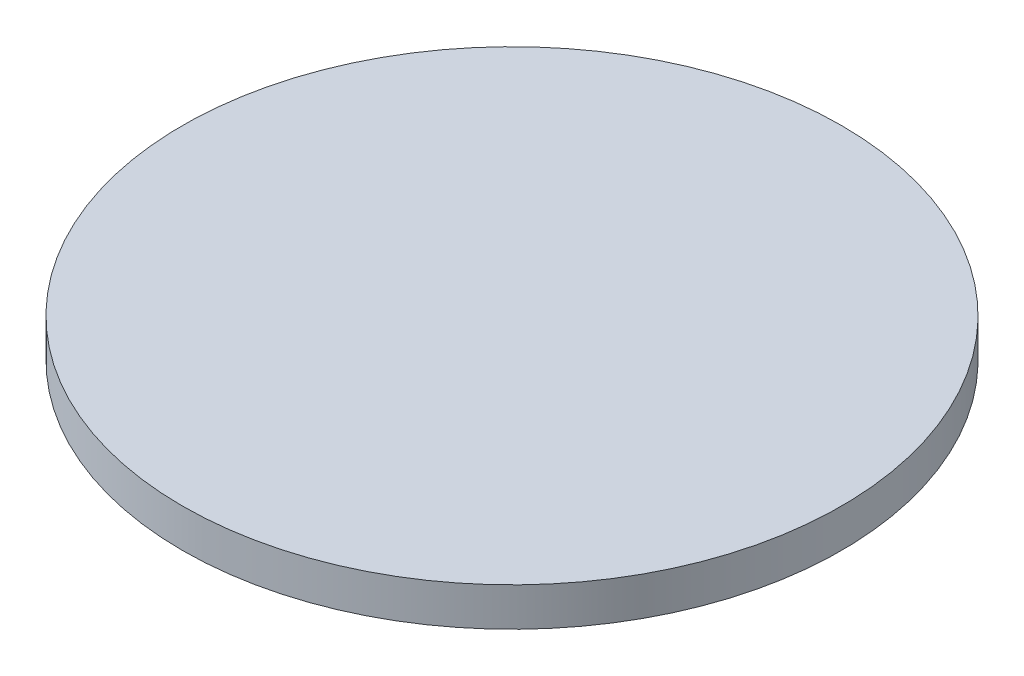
from build123d import *

# Parameters (mm, degrees)
SKETCH1_R           = 27.178
BOSS_EXTRUDE1_DEPTH = 3.175


with BuildPart() as part:
    # Sketch1 → Boss-Extrude1 (new body)
    with BuildSketch(Plane(origin=(0, 0, 0), x_dir=(1, 0, 0), z_dir=(0, 1, 0))):
        with Locations(Location((0, 0, 0), (0, 0, 270))):
            Circle(SKETCH1_R)
    extrude(amount=BOSS_EXTRUDE1_DEPTH)


solid = part.part
